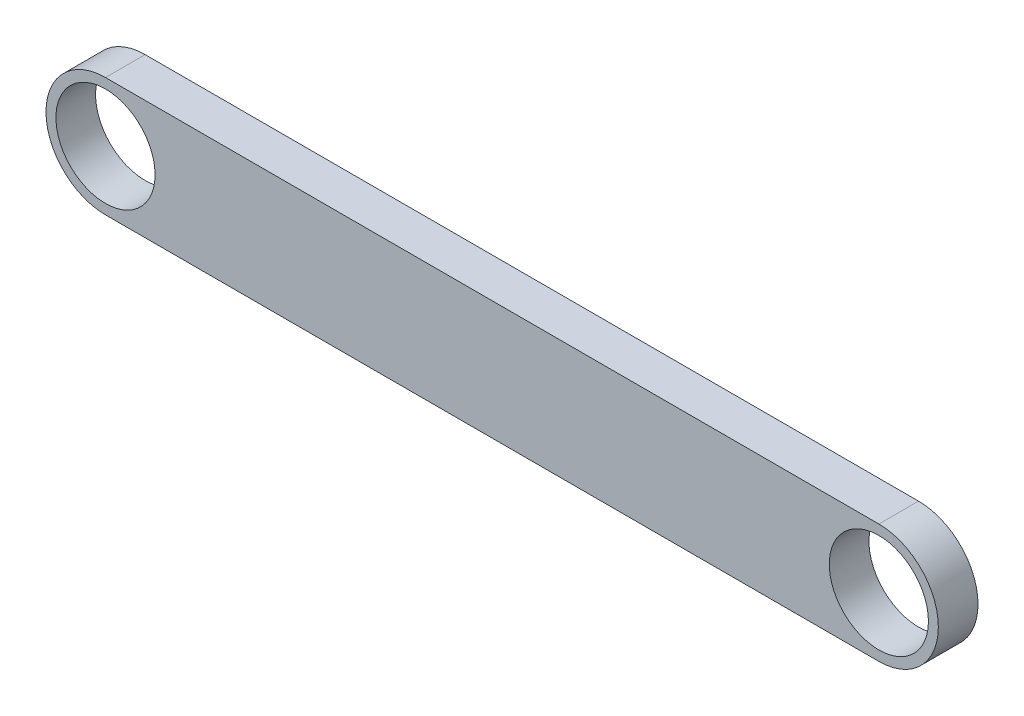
from build123d import *

# Parameters (mm, degrees)
SKETCH1_R           = 12.5
BOSS_EXTRUDE1_DEPTH = 10


with BuildPart() as part:
    # Sketch1 → Boss-Extrude1 (new body)
    with BuildSketch(Plane.XY):
        with BuildLine():
            Line((0, 15), (195, 15))
            ThreePointArc((195, 15), (210, 0), (195, -15))
            Line((195, -15), (0, -15))
            ThreePointArc((0, -15), (-15, 0), (0, 15))
        make_face()
        Circle(SKETCH1_R, mode=Mode.SUBTRACT)
        with Locations((195, 0)):
            Circle(SKETCH1_R, mode=Mode.SUBTRACT)
    extrude(amount=BOSS_EXTRUDE1_DEPTH)


solid = part.part
